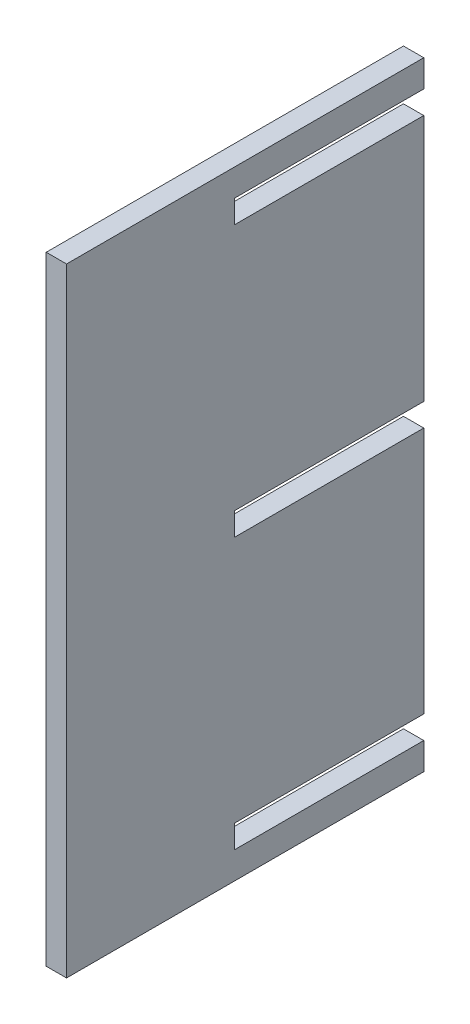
ISO-10303-21;
HEADER;
FILE_DESCRIPTION(('STEP AP214'),'2;1');
FILE_NAME('part.step','',(''),(''),'','','');
FILE_SCHEMA(('AUTOMOTIVE_DESIGN { 1 0 10303 214 1 1 1 1 }'));
ENDSEC;
DATA;
#1=APPLICATION_CONTEXT('core data for automotive mechanical design processes');
#2=APPLICATION_PROTOCOL_DEFINITION('international standard','automotive_design',2000,#1);
#3=PRODUCT_CONTEXT('',#1,'mechanical');
#4=PRODUCT('Part','Part','',(#3));
#5=PRODUCT_RELATED_PRODUCT_CATEGORY('part','',(#4));
#6=PRODUCT_DEFINITION_FORMATION('','',#4);
#7=PRODUCT_DEFINITION_CONTEXT('part definition',#1,'design');
#8=PRODUCT_DEFINITION('design','',#6,#7);
#9=PRODUCT_DEFINITION_SHAPE('','',#8);
#10=(LENGTH_UNIT() NAMED_UNIT(*) SI_UNIT(.MILLI.,.METRE.));
#11=(NAMED_UNIT(*) PLANE_ANGLE_UNIT() SI_UNIT($,.RADIAN.));
#12=(NAMED_UNIT(*) SI_UNIT($,.STERADIAN.) SOLID_ANGLE_UNIT());
#13=UNCERTAINTY_MEASURE_WITH_UNIT(LENGTH_MEASURE(1.E-05),#10,'distance_accuracy_value','');
#14=(GEOMETRIC_REPRESENTATION_CONTEXT(3) GLOBAL_UNCERTAINTY_ASSIGNED_CONTEXT((#13)) GLOBAL_UNIT_ASSIGNED_CONTEXT((#10,
#11,#12)) REPRESENTATION_CONTEXT('',''));
#15=CARTESIAN_POINT('',(0.,0.,0.));
#16=DIRECTION('',(0.,0.,1.));
#17=DIRECTION('',(1.,0.,0.));
#18=AXIS2_PLACEMENT_3D('',#15,#16,#17);
#19=CARTESIAN_POINT('',(0.,0.,0.));
#20=DIRECTION('',(0.,0.,-1.));
#21=DIRECTION('',(-1.,0.,0.));
#22=AXIS2_PLACEMENT_3D('',#19,#20,#21);
#23=PLANE('',#22);
#24=DIRECTION('',(1.,0.,0.));
#25=VECTOR('',#24,1.);
#26=CARTESIAN_POINT('',(-32.352836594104,19.15,0.));
#27=LINE('',#26,#25);
#28=CARTESIAN_POINT('',(-18.25,19.15,0.));
#29=VERTEX_POINT('',#28);
#30=CARTESIAN_POINT('',(-16.75,19.15,0.));
#31=VERTEX_POINT('',#30);
#32=EDGE_CURVE('E177',#29,#31,#27,.T.);
#33=ORIENTED_EDGE('',*,*,#32,.T.);
#34=DIRECTION('',(0.,1.,0.));
#35=VECTOR('',#34,1.);
#36=CARTESIAN_POINT('',(-16.75,-39.75,0.));
#37=LINE('',#36,#35);
#38=CARTESIAN_POINT('',(-16.75,0.849999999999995,0.));
#39=VERTEX_POINT('',#38);
#40=EDGE_CURVE('E252',#39,#31,#37,.T.);
#41=ORIENTED_EDGE('',*,*,#40,.F.);
#42=DIRECTION('',(1.,0.,0.));
#43=VECTOR('',#42,1.);
#44=CARTESIAN_POINT('',(-32.352836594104,0.849999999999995,0.));
#45=LINE('',#44,#43);
#46=CARTESIAN_POINT('',(-18.25,0.849999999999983,0.));
#47=VERTEX_POINT('',#46);
#48=EDGE_CURVE('E211',#47,#39,#45,.T.);
#49=ORIENTED_EDGE('',*,*,#48,.F.);
#50=DIRECTION('',(0.,-1.,0.));
#51=VECTOR('',#50,1.);
#52=CARTESIAN_POINT('',(-18.25,-39.75,0.));
#53=LINE('',#52,#51);
#54=EDGE_CURVE('E248',#29,#47,#53,.T.);
#55=ORIENTED_EDGE('',*,*,#54,.F.);
#56=EDGE_LOOP('',(#33,#41,#49,#55));
#57=FACE_BOUND('',#56,.T.);
#58=ADVANCED_FACE('F33',(#57),#23,.T.);
#59=DIRECTION('',(1.,0.,0.));
#60=VECTOR('',#59,1.);
#61=CARTESIAN_POINT('',(-32.352836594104,-0.850000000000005,0.));
#62=LINE('',#61,#60);
#63=CARTESIAN_POINT('',(-18.25,-0.850000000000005,0.));
#64=VERTEX_POINT('',#63);
#65=CARTESIAN_POINT('',(-16.75,-0.850000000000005,0.));
#66=VERTEX_POINT('',#65);
#67=EDGE_CURVE('E201',#64,#66,#62,.T.);
#68=ORIENTED_EDGE('',*,*,#67,.T.);
#69=CARTESIAN_POINT('',(-16.75,-19.15,0.));
#70=VERTEX_POINT('',#69);
#71=EDGE_CURVE('E271',#70,#66,#37,.T.);
#72=ORIENTED_EDGE('',*,*,#71,.F.);
#73=DIRECTION('',(1.,0.,0.));
#74=VECTOR('',#73,1.);
#75=CARTESIAN_POINT('',(-32.352836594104,-19.15,0.));
#76=LINE('',#75,#74);
#77=CARTESIAN_POINT('',(-18.25,-19.15,0.));
#78=VERTEX_POINT('',#77);
#79=EDGE_CURVE('E236',#78,#70,#76,.T.);
#80=ORIENTED_EDGE('',*,*,#79,.F.);
#81=EDGE_CURVE('E253',#64,#78,#53,.T.);
#82=ORIENTED_EDGE('',*,*,#81,.F.);
#83=EDGE_LOOP('',(#68,#72,#80,#82));
#84=FACE_BOUND('',#83,.T.);
#85=ADVANCED_FACE('F269',(#84),#23,.T.);
#86=DIRECTION('',(1.,0.,0.));
#87=VECTOR('',#86,1.);
#88=CARTESIAN_POINT('',(-49.5959726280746,-22.85,0.));
#89=LINE('',#88,#87);
#90=CARTESIAN_POINT('',(-18.25,-22.85,0.));
#91=VERTEX_POINT('',#90);
#92=CARTESIAN_POINT('',(-16.75,-22.85,0.));
#93=VERTEX_POINT('',#92);
#94=EDGE_CURVE('E167',#91,#93,#89,.T.);
#95=ORIENTED_EDGE('',*,*,#94,.F.);
#96=CARTESIAN_POINT('',(-18.25,-20.85,0.));
#97=VERTEX_POINT('',#96);
#98=EDGE_CURVE('E246',#97,#91,#53,.T.);
#99=ORIENTED_EDGE('',*,*,#98,.F.);
#100=DIRECTION('',(1.,0.,0.));
#101=VECTOR('',#100,1.);
#102=CARTESIAN_POINT('',(-32.352836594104,-20.85,0.));
#103=LINE('',#102,#101);
#104=CARTESIAN_POINT('',(-16.75,-20.85,0.));
#105=VERTEX_POINT('',#104);
#106=EDGE_CURVE('E225',#97,#105,#103,.T.);
#107=ORIENTED_EDGE('',*,*,#106,.T.);
#108=EDGE_CURVE('E37',#93,#105,#37,.T.);
#109=ORIENTED_EDGE('',*,*,#108,.F.);
#110=EDGE_LOOP('',(#95,#99,#107,#109));
#111=FACE_BOUND('',#110,.T.);
#112=ADVANCED_FACE('F302',(#111),#23,.T.);
#113=CARTESIAN_POINT('',(-18.25,-39.75,26.4));
#114=DIRECTION('',(1.,0.,0.));
#115=DIRECTION('',(0.,0.,-1.));
#116=AXIS2_PLACEMENT_3D('',#113,#114,#115);
#117=PLANE('',#116);
#118=DIRECTION('',(0.,-1.,0.));
#119=VECTOR('',#118,1.);
#120=CARTESIAN_POINT('',(-18.25,-39.75,26.4));
#121=LINE('',#120,#119);
#122=CARTESIAN_POINT('',(-18.25,22.85,26.4));
#123=VERTEX_POINT('',#122);
#124=CARTESIAN_POINT('',(-18.25,-22.85,26.4));
#125=VERTEX_POINT('',#124);
#126=EDGE_CURVE('E42',#123,#125,#121,.T.);
#127=ORIENTED_EDGE('',*,*,#126,.F.);
#128=DIRECTION('',(0.,0.,1.));
#129=VECTOR('',#128,1.);
#130=CARTESIAN_POINT('',(-18.25,22.85,0.));
#131=LINE('',#130,#129);
#132=CARTESIAN_POINT('',(-18.25,22.85,0.));
#133=VERTEX_POINT('',#132);
#134=EDGE_CURVE('E150',#133,#123,#131,.T.);
#135=ORIENTED_EDGE('',*,*,#134,.F.);
#136=CARTESIAN_POINT('',(-18.25,20.85,0.));
#137=VERTEX_POINT('',#136);
#138=EDGE_CURVE('E247',#133,#137,#53,.T.);
#139=ORIENTED_EDGE('',*,*,#138,.T.);
#140=DIRECTION('',(0.,0.,-1.));
#141=VECTOR('',#140,1.);
#142=CARTESIAN_POINT('',(-18.25,20.85,0.));
#143=LINE('',#142,#141);
#144=CARTESIAN_POINT('',(-18.25,20.85,14.));
#145=VERTEX_POINT('',#144);
#146=EDGE_CURVE('E179',#145,#137,#143,.T.);
#147=ORIENTED_EDGE('',*,*,#146,.F.);
#148=DIRECTION('',(0.,1.,0.));
#149=VECTOR('',#148,1.);
#150=CARTESIAN_POINT('',(-18.25,19.15,14.));
#151=LINE('',#150,#149);
#152=CARTESIAN_POINT('',(-18.25,19.15,14.));
#153=VERTEX_POINT('',#152);
#154=EDGE_CURVE('E174',#153,#145,#151,.T.);
#155=ORIENTED_EDGE('',*,*,#154,.F.);
#156=DIRECTION('',(0.,0.,1.));
#157=VECTOR('',#156,1.);
#158=CARTESIAN_POINT('',(-18.25,19.15,0.));
#159=LINE('',#158,#157);
#160=EDGE_CURVE('E176',#29,#153,#159,.T.);
#161=ORIENTED_EDGE('',*,*,#160,.F.);
#162=ORIENTED_EDGE('',*,*,#54,.T.);
#163=DIRECTION('',(0.,0.,-1.));
#164=VECTOR('',#163,1.);
#165=CARTESIAN_POINT('',(-18.25,0.849999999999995,0.));
#166=LINE('',#165,#164);
#167=CARTESIAN_POINT('',(-18.25,0.849999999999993,14.));
#168=VERTEX_POINT('',#167);
#169=EDGE_CURVE('E203',#168,#47,#166,.T.);
#170=ORIENTED_EDGE('',*,*,#169,.F.);
#171=DIRECTION('',(0.,1.,0.));
#172=VECTOR('',#171,1.);
#173=CARTESIAN_POINT('',(-18.25,-0.850000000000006,14.));
#174=LINE('',#173,#172);
#175=CARTESIAN_POINT('',(-18.25,-0.850000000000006,14.));
#176=VERTEX_POINT('',#175);
#177=EDGE_CURVE('E198',#176,#168,#174,.T.);
#178=ORIENTED_EDGE('',*,*,#177,.F.);
#179=DIRECTION('',(0.,0.,1.));
#180=VECTOR('',#179,1.);
#181=CARTESIAN_POINT('',(-18.25,-0.850000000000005,0.));
#182=LINE('',#181,#180);
#183=EDGE_CURVE('E200',#64,#176,#182,.T.);
#184=ORIENTED_EDGE('',*,*,#183,.F.);
#185=ORIENTED_EDGE('',*,*,#81,.T.);
#186=DIRECTION('',(0.,0.,-1.));
#187=VECTOR('',#186,1.);
#188=CARTESIAN_POINT('',(-18.25,-19.15,0.));
#189=LINE('',#188,#187);
#190=CARTESIAN_POINT('',(-18.25,-19.15,14.));
#191=VERTEX_POINT('',#190);
#192=EDGE_CURVE('E227',#191,#78,#189,.T.);
#193=ORIENTED_EDGE('',*,*,#192,.F.);
#194=DIRECTION('',(0.,1.,0.));
#195=VECTOR('',#194,1.);
#196=CARTESIAN_POINT('',(-18.25,-20.85,14.));
#197=LINE('',#196,#195);
#198=CARTESIAN_POINT('',(-18.25,-20.85,14.));
#199=VERTEX_POINT('',#198);
#200=EDGE_CURVE('E222',#199,#191,#197,.T.);
#201=ORIENTED_EDGE('',*,*,#200,.F.);
#202=DIRECTION('',(0.,0.,1.));
#203=VECTOR('',#202,1.);
#204=CARTESIAN_POINT('',(-18.25,-20.85,0.));
#205=LINE('',#204,#203);
#206=EDGE_CURVE('E224',#97,#199,#205,.T.);
#207=ORIENTED_EDGE('',*,*,#206,.F.);
#208=ORIENTED_EDGE('',*,*,#98,.T.);
#209=DIRECTION('',(0.,0.,-1.));
#210=VECTOR('',#209,1.);
#211=CARTESIAN_POINT('',(-18.25,-22.85,0.));
#212=LINE('',#211,#210);
#213=EDGE_CURVE('E166',#125,#91,#212,.T.);
#214=ORIENTED_EDGE('',*,*,#213,.F.);
#215=EDGE_LOOP('',(#127,#135,#139,#147,#155,#161,#162,#170,#178,#184,#185,#193,#201,#207,#208,#214));
#216=FACE_BOUND('',#215,.T.);
#217=ADVANCED_FACE('F35',(#216),#117,.F.);
#218=CARTESIAN_POINT('',(-16.75,-39.75,26.4));
#219=DIRECTION('',(-1.,0.,0.));
#220=DIRECTION('',(0.,0.,1.));
#221=AXIS2_PLACEMENT_3D('',#218,#219,#220);
#222=PLANE('',#221);
#223=CARTESIAN_POINT('',(-16.75,20.85,0.));
#224=VERTEX_POINT('',#223);
#225=CARTESIAN_POINT('',(-16.75,22.85,0.));
#226=VERTEX_POINT('',#225);
#227=EDGE_CURVE('E161',#224,#226,#37,.T.);
#228=ORIENTED_EDGE('',*,*,#227,.T.);
#229=DIRECTION('',(0.,0.,-1.));
#230=VECTOR('',#229,1.);
#231=CARTESIAN_POINT('',(-16.75,22.85,0.));
#232=LINE('',#231,#230);
#233=CARTESIAN_POINT('',(-16.75,22.85,26.4));
#234=VERTEX_POINT('',#233);
#235=EDGE_CURVE('E50',#234,#226,#232,.T.);
#236=ORIENTED_EDGE('',*,*,#235,.F.);
#237=DIRECTION('',(0.,1.,0.));
#238=VECTOR('',#237,1.);
#239=CARTESIAN_POINT('',(-16.75,-39.75,26.4));
#240=LINE('',#239,#238);
#241=CARTESIAN_POINT('',(-16.75,-22.85,26.4));
#242=VERTEX_POINT('',#241);
#243=EDGE_CURVE('E11',#242,#234,#240,.T.);
#244=ORIENTED_EDGE('',*,*,#243,.F.);
#245=DIRECTION('',(0.,0.,1.));
#246=VECTOR('',#245,1.);
#247=CARTESIAN_POINT('',(-16.75,-22.85,0.));
#248=LINE('',#247,#246);
#249=EDGE_CURVE('E58',#93,#242,#248,.T.);
#250=ORIENTED_EDGE('',*,*,#249,.F.);
#251=ORIENTED_EDGE('',*,*,#108,.T.);
#252=DIRECTION('',(0.,0.,-1.));
#253=VECTOR('',#252,1.);
#254=CARTESIAN_POINT('',(-16.75,-20.85,0.));
#255=LINE('',#254,#253);
#256=CARTESIAN_POINT('',(-16.75,-20.85,14.));
#257=VERTEX_POINT('',#256);
#258=EDGE_CURVE('E233',#257,#105,#255,.T.);
#259=ORIENTED_EDGE('',*,*,#258,.F.);
#260=DIRECTION('',(0.,-1.,0.));
#261=VECTOR('',#260,1.);
#262=CARTESIAN_POINT('',(-16.75,-20.85,14.));
#263=LINE('',#262,#261);
#264=CARTESIAN_POINT('',(-16.75,-19.15,14.));
#265=VERTEX_POINT('',#264);
#266=EDGE_CURVE('E230',#265,#257,#263,.T.);
#267=ORIENTED_EDGE('',*,*,#266,.F.);
#268=DIRECTION('',(0.,0.,1.));
#269=VECTOR('',#268,1.);
#270=CARTESIAN_POINT('',(-16.75,-19.15,0.));
#271=LINE('',#270,#269);
#272=EDGE_CURVE('E221',#70,#265,#271,.T.);
#273=ORIENTED_EDGE('',*,*,#272,.F.);
#274=ORIENTED_EDGE('',*,*,#71,.T.);
#275=DIRECTION('',(0.,0.,-1.));
#276=VECTOR('',#275,1.);
#277=CARTESIAN_POINT('',(-16.75,-0.850000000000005,0.));
#278=LINE('',#277,#276);
#279=CARTESIAN_POINT('',(-16.75,-0.850000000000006,14.));
#280=VERTEX_POINT('',#279);
#281=EDGE_CURVE('E209',#280,#66,#278,.T.);
#282=ORIENTED_EDGE('',*,*,#281,.F.);
#283=DIRECTION('',(0.,-1.,0.));
#284=VECTOR('',#283,1.);
#285=CARTESIAN_POINT('',(-16.75,-0.850000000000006,14.));
#286=LINE('',#285,#284);
#287=CARTESIAN_POINT('',(-16.75,0.849999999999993,14.));
#288=VERTEX_POINT('',#287);
#289=EDGE_CURVE('E206',#288,#280,#286,.T.);
#290=ORIENTED_EDGE('',*,*,#289,.F.);
#291=DIRECTION('',(0.,0.,1.));
#292=VECTOR('',#291,1.);
#293=CARTESIAN_POINT('',(-16.75,0.849999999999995,0.));
#294=LINE('',#293,#292);
#295=EDGE_CURVE('E197',#39,#288,#294,.T.);
#296=ORIENTED_EDGE('',*,*,#295,.F.);
#297=ORIENTED_EDGE('',*,*,#40,.T.);
#298=DIRECTION('',(0.,0.,-1.));
#299=VECTOR('',#298,1.);
#300=CARTESIAN_POINT('',(-16.75,19.15,0.));
#301=LINE('',#300,#299);
#302=CARTESIAN_POINT('',(-16.75,19.15,14.));
#303=VERTEX_POINT('',#302);
#304=EDGE_CURVE('E185',#303,#31,#301,.T.);
#305=ORIENTED_EDGE('',*,*,#304,.F.);
#306=DIRECTION('',(0.,-1.,0.));
#307=VECTOR('',#306,1.);
#308=CARTESIAN_POINT('',(-16.75,19.15,14.));
#309=LINE('',#308,#307);
#310=CARTESIAN_POINT('',(-16.75,20.85,14.));
#311=VERTEX_POINT('',#310);
#312=EDGE_CURVE('E182',#311,#303,#309,.T.);
#313=ORIENTED_EDGE('',*,*,#312,.F.);
#314=DIRECTION('',(0.,0.,1.));
#315=VECTOR('',#314,1.);
#316=CARTESIAN_POINT('',(-16.75,20.85,0.));
#317=LINE('',#316,#315);
#318=EDGE_CURVE('E169',#224,#311,#317,.T.);
#319=ORIENTED_EDGE('',*,*,#318,.F.);
#320=EDGE_LOOP('',(#228,#236,#244,#250,#251,#259,#267,#273,#274,#282,#290,#296,#297,#305,#313,#319));
#321=FACE_BOUND('',#320,.T.);
#322=ADVANCED_FACE('F158',(#321),#222,.F.);
#323=CARTESIAN_POINT('',(0.,0.,26.4));
#324=DIRECTION('',(0.,0.,-1.));
#325=DIRECTION('',(-1.,0.,0.));
#326=AXIS2_PLACEMENT_3D('',#323,#324,#325);
#327=PLANE('',#326);
#328=ORIENTED_EDGE('',*,*,#243,.T.);
#329=DIRECTION('',(1.,0.,0.));
#330=VECTOR('',#329,1.);
#331=CARTESIAN_POINT('',(-49.5959726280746,22.85,26.4));
#332=LINE('',#331,#330);
#333=EDGE_CURVE('E147',#123,#234,#332,.T.);
#334=ORIENTED_EDGE('',*,*,#333,.F.);
#335=ORIENTED_EDGE('',*,*,#126,.T.);
#336=DIRECTION('',(1.,0.,0.));
#337=VECTOR('',#336,1.);
#338=CARTESIAN_POINT('',(-49.5959726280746,-22.85,26.4));
#339=LINE('',#338,#337);
#340=EDGE_CURVE('E164',#125,#242,#339,.T.);
#341=ORIENTED_EDGE('',*,*,#340,.T.);
#342=EDGE_LOOP('',(#328,#334,#335,#341));
#343=FACE_BOUND('',#342,.T.);
#344=ADVANCED_FACE('F163',(#343),#327,.F.);
#345=DIRECTION('',(1.,0.,0.));
#346=VECTOR('',#345,1.);
#347=CARTESIAN_POINT('',(-49.5959726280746,22.85,0.));
#348=LINE('',#347,#346);
#349=EDGE_CURVE('E153',#133,#226,#348,.T.);
#350=ORIENTED_EDGE('',*,*,#349,.T.);
#351=ORIENTED_EDGE('',*,*,#227,.F.);
#352=DIRECTION('',(1.,0.,0.));
#353=VECTOR('',#352,1.);
#354=CARTESIAN_POINT('',(-32.352836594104,20.85,0.));
#355=LINE('',#354,#353);
#356=EDGE_CURVE('E187',#137,#224,#355,.T.);
#357=ORIENTED_EDGE('',*,*,#356,.F.);
#358=ORIENTED_EDGE('',*,*,#138,.F.);
#359=EDGE_LOOP('',(#350,#351,#357,#358));
#360=FACE_BOUND('',#359,.T.);
#361=ADVANCED_FACE('F295',(#360),#23,.T.);
#362=CARTESIAN_POINT('',(-32.352836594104,-20.85,0.));
#363=DIRECTION('',(0.,-1.,0.));
#364=DIRECTION('',(0.,0.,-1.));
#365=AXIS2_PLACEMENT_3D('',#362,#363,#364);
#366=PLANE('',#365);
#367=ORIENTED_EDGE('',*,*,#206,.T.);
#368=DIRECTION('',(1.,0.,0.));
#369=VECTOR('',#368,1.);
#370=CARTESIAN_POINT('',(-32.352836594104,-20.85,14.));
#371=LINE('',#370,#369);
#372=EDGE_CURVE('E239',#199,#257,#371,.T.);
#373=ORIENTED_EDGE('',*,*,#372,.T.);
#374=ORIENTED_EDGE('',*,*,#258,.T.);
#375=ORIENTED_EDGE('',*,*,#106,.F.);
#376=EDGE_LOOP('',(#367,#373,#374,#375));
#377=FACE_BOUND('',#376,.T.);
#378=ADVANCED_FACE('F306',(#377),#366,.F.);
#379=CARTESIAN_POINT('',(-32.352836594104,-20.85,14.));
#380=DIRECTION('',(0.,0.,1.));
#381=DIRECTION('',(1.,0.,0.));
#382=AXIS2_PLACEMENT_3D('',#379,#380,#381);
#383=PLANE('',#382);
#384=ORIENTED_EDGE('',*,*,#200,.T.);
#385=DIRECTION('',(1.,0.,0.));
#386=VECTOR('',#385,1.);
#387=CARTESIAN_POINT('',(-32.352836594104,-19.15,14.));
#388=LINE('',#387,#386);
#389=EDGE_CURVE('E241',#191,#265,#388,.T.);
#390=ORIENTED_EDGE('',*,*,#389,.T.);
#391=ORIENTED_EDGE('',*,*,#266,.T.);
#392=ORIENTED_EDGE('',*,*,#372,.F.);
#393=EDGE_LOOP('',(#384,#390,#391,#392));
#394=FACE_BOUND('',#393,.T.);
#395=ADVANCED_FACE('F309',(#394),#383,.F.);
#396=CARTESIAN_POINT('',(-32.352836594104,-19.15,0.));
#397=DIRECTION('',(0.,1.,0.));
#398=DIRECTION('',(0.,0.,1.));
#399=AXIS2_PLACEMENT_3D('',#396,#397,#398);
#400=PLANE('',#399);
#401=ORIENTED_EDGE('',*,*,#192,.T.);
#402=ORIENTED_EDGE('',*,*,#79,.T.);
#403=ORIENTED_EDGE('',*,*,#272,.T.);
#404=ORIENTED_EDGE('',*,*,#389,.F.);
#405=EDGE_LOOP('',(#401,#402,#403,#404));
#406=FACE_BOUND('',#405,.T.);
#407=ADVANCED_FACE('F266',(#406),#400,.F.);
#408=CARTESIAN_POINT('',(-32.352836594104,-0.850000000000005,0.));
#409=DIRECTION('',(0.,-1.,0.));
#410=DIRECTION('',(0.,0.,-1.));
#411=AXIS2_PLACEMENT_3D('',#408,#409,#410);
#412=PLANE('',#411);
#413=ORIENTED_EDGE('',*,*,#183,.T.);
#414=DIRECTION('',(1.,0.,0.));
#415=VECTOR('',#414,1.);
#416=CARTESIAN_POINT('',(-32.352836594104,-0.850000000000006,14.));
#417=LINE('',#416,#415);
#418=EDGE_CURVE('E214',#176,#280,#417,.T.);
#419=ORIENTED_EDGE('',*,*,#418,.T.);
#420=ORIENTED_EDGE('',*,*,#281,.T.);
#421=ORIENTED_EDGE('',*,*,#67,.F.);
#422=EDGE_LOOP('',(#413,#419,#420,#421));
#423=FACE_BOUND('',#422,.T.);
#424=ADVANCED_FACE('F316',(#423),#412,.F.);
#425=CARTESIAN_POINT('',(-32.352836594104,-0.850000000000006,14.));
#426=DIRECTION('',(0.,0.,1.));
#427=DIRECTION('',(1.,0.,0.));
#428=AXIS2_PLACEMENT_3D('',#425,#426,#427);
#429=PLANE('',#428);
#430=ORIENTED_EDGE('',*,*,#177,.T.);
#431=DIRECTION('',(1.,0.,0.));
#432=VECTOR('',#431,1.);
#433=CARTESIAN_POINT('',(-32.352836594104,0.849999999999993,14.));
#434=LINE('',#433,#432);
#435=EDGE_CURVE('E216',#168,#288,#434,.T.);
#436=ORIENTED_EDGE('',*,*,#435,.T.);
#437=ORIENTED_EDGE('',*,*,#289,.T.);
#438=ORIENTED_EDGE('',*,*,#418,.F.);
#439=EDGE_LOOP('',(#430,#436,#437,#438));
#440=FACE_BOUND('',#439,.T.);
#441=ADVANCED_FACE('F378',(#440),#429,.F.);
#442=CARTESIAN_POINT('',(-32.352836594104,0.849999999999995,0.));
#443=DIRECTION('',(0.,1.,0.));
#444=DIRECTION('',(0.,0.,1.));
#445=AXIS2_PLACEMENT_3D('',#442,#443,#444);
#446=PLANE('',#445);
#447=ORIENTED_EDGE('',*,*,#169,.T.);
#448=ORIENTED_EDGE('',*,*,#48,.T.);
#449=ORIENTED_EDGE('',*,*,#295,.T.);
#450=ORIENTED_EDGE('',*,*,#435,.F.);
#451=EDGE_LOOP('',(#447,#448,#449,#450));
#452=FACE_BOUND('',#451,.T.);
#453=ADVANCED_FACE('F372',(#452),#446,.F.);
#454=CARTESIAN_POINT('',(-32.352836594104,19.15,0.));
#455=DIRECTION('',(0.,-1.,0.));
#456=DIRECTION('',(0.,0.,-1.));
#457=AXIS2_PLACEMENT_3D('',#454,#455,#456);
#458=PLANE('',#457);
#459=ORIENTED_EDGE('',*,*,#160,.T.);
#460=DIRECTION('',(1.,0.,0.));
#461=VECTOR('',#460,1.);
#462=CARTESIAN_POINT('',(-32.352836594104,19.15,14.));
#463=LINE('',#462,#461);
#464=EDGE_CURVE('E190',#153,#303,#463,.T.);
#465=ORIENTED_EDGE('',*,*,#464,.T.);
#466=ORIENTED_EDGE('',*,*,#304,.T.);
#467=ORIENTED_EDGE('',*,*,#32,.F.);
#468=EDGE_LOOP('',(#459,#465,#466,#467));
#469=FACE_BOUND('',#468,.T.);
#470=ADVANCED_FACE('F284',(#469),#458,.F.);
#471=CARTESIAN_POINT('',(-32.352836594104,19.15,14.));
#472=DIRECTION('',(0.,0.,1.));
#473=DIRECTION('',(1.,0.,0.));
#474=AXIS2_PLACEMENT_3D('',#471,#472,#473);
#475=PLANE('',#474);
#476=ORIENTED_EDGE('',*,*,#154,.T.);
#477=DIRECTION('',(1.,0.,0.));
#478=VECTOR('',#477,1.);
#479=CARTESIAN_POINT('',(-32.352836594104,20.85,14.));
#480=LINE('',#479,#478);
#481=EDGE_CURVE('E192',#145,#311,#480,.T.);
#482=ORIENTED_EDGE('',*,*,#481,.T.);
#483=ORIENTED_EDGE('',*,*,#312,.T.);
#484=ORIENTED_EDGE('',*,*,#464,.F.);
#485=EDGE_LOOP('',(#476,#482,#483,#484));
#486=FACE_BOUND('',#485,.T.);
#487=ADVANCED_FACE('F290',(#486),#475,.F.);
#488=CARTESIAN_POINT('',(-32.352836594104,20.85,0.));
#489=DIRECTION('',(0.,1.,0.));
#490=DIRECTION('',(0.,0.,1.));
#491=AXIS2_PLACEMENT_3D('',#488,#489,#490);
#492=PLANE('',#491);
#493=ORIENTED_EDGE('',*,*,#146,.T.);
#494=ORIENTED_EDGE('',*,*,#356,.T.);
#495=ORIENTED_EDGE('',*,*,#318,.T.);
#496=ORIENTED_EDGE('',*,*,#481,.F.);
#497=EDGE_LOOP('',(#493,#494,#495,#496));
#498=FACE_BOUND('',#497,.T.);
#499=ADVANCED_FACE('F292',(#498),#492,.F.);
#500=CARTESIAN_POINT('',(-49.5959726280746,-22.85,0.));
#501=DIRECTION('',(0.,1.,0.));
#502=DIRECTION('',(0.,0.,1.));
#503=AXIS2_PLACEMENT_3D('',#500,#501,#502);
#504=PLANE('',#503);
#505=ORIENTED_EDGE('',*,*,#213,.T.);
#506=ORIENTED_EDGE('',*,*,#94,.T.);
#507=ORIENTED_EDGE('',*,*,#249,.T.);
#508=ORIENTED_EDGE('',*,*,#340,.F.);
#509=EDGE_LOOP('',(#505,#506,#507,#508));
#510=FACE_BOUND('',#509,.T.);
#511=ADVANCED_FACE('F299',(#510),#504,.F.);
#512=CARTESIAN_POINT('',(-49.5959726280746,22.85,0.));
#513=DIRECTION('',(0.,-1.,0.));
#514=DIRECTION('',(0.,0.,-1.));
#515=AXIS2_PLACEMENT_3D('',#512,#513,#514);
#516=PLANE('',#515);
#517=ORIENTED_EDGE('',*,*,#134,.T.);
#518=ORIENTED_EDGE('',*,*,#333,.T.);
#519=ORIENTED_EDGE('',*,*,#235,.T.);
#520=ORIENTED_EDGE('',*,*,#349,.F.);
#521=EDGE_LOOP('',(#517,#518,#519,#520));
#522=FACE_BOUND('',#521,.T.);
#523=ADVANCED_FACE('F148',(#522),#516,.F.);
#524=CLOSED_SHELL('',(#58,#85,#112,#217,#322,#344,#361,#378,#395,#407,#424,#441,#453,#470,#487,
#499,#511,#523));
#525=MANIFOLD_SOLID_BREP('B2',#524);
#526=ADVANCED_BREP_SHAPE_REPRESENTATION('',(#18,#525),#14);
#527=SHAPE_DEFINITION_REPRESENTATION(#9,#526);
ENDSEC;
END-ISO-10303-21;
